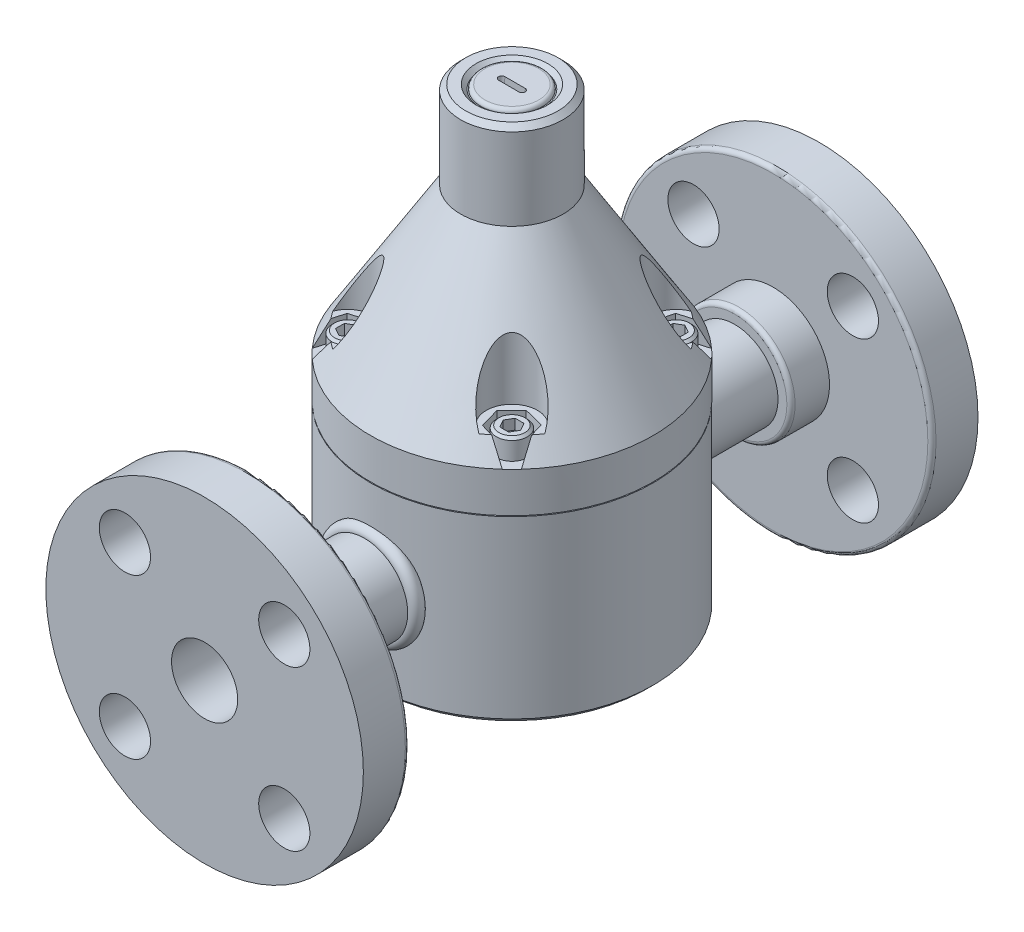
from build123d import *

# Parameters (mm, degrees)
SKETCH1_R                = 43.815
EXTRUDE1_DEPTH           = 140.97
SKETCH3_R                = 11.1125
EXTRUDE2_DEPTH           = 1.27
EXTRUDE2_DRAFT           = -45
CHAMFER1_SIZE            = 1.5748
SKETCH4_R                = 9.525
EXTRUDE3_DEPTH           = 1.27
FILLET1_R                = 1.143
EXTRUDE4_DEPTH           = 3.302
EXTRUDE4_DRAFT           = -1
SKETCH6_R                = 7.9375
EXTRUDE5_DEPTH           = 22.86
EXTRUDE6_DEPTH           = 6.35
CIRPATTERN1_COUNT        = 4
SKETCH9_R                = 4.7625
EXTRUDE7_DEPTH           = 6.35
EXTRUDE8_DEPTH           = 3.175
CIRPATTERN2_COUNT        = 4
CHAMFER2_SIZE            = 0.762
SKETCH11_R               = 49.2125
BOSS_EXTRUDE1_DEPTH      = 14.2748
SKETCH12_R               = 17.4625
BOSS_EXTRUDE2_DEPTH      = 26.2128
BOSS_EXTRUDE3_REACH      = 206.043
BOSS_EXTRUDE3_END_RADIUS = 43.815
SKETCH13_R               = 13.4366
SKETCH14_R               = 10.2616
CUT_EXTRUDE1_DEPTH       = 25.4
SKETCH15_R               = 7.9375
CUT_EXTRUDE2_DEPTH       = 25.4
CIRPATTERN3_COUNT        = 4
SKETCH18_R               = 49.2125
BOSS_EXTRUDE5_DEPTH      = 14.2748
BOSS_EXTRUDE6_START      = 26.2128
SKETCH19_R               = 17.4625
BOSS_EXTRUDE6_DEPTH      = 26.2128
BOSS_EXTRUDE7_REACH      = 244.043
BOSS_EXTRUDE7_END_RADIUS = 43.815
SKETCH20_R               = 13.4366
CUT_EXTRUDE3_START       = 25.4
SKETCH21_R               = 10.2616
CUT_EXTRUDE3_DEPTH       = 25.4
CUT_EXTRUDE4_START       = 25.4
SKETCH22_R               = 7.9375
CUT_EXTRUDE4_DEPTH       = 25.4
CIRPATTERN4_COUNT        = 4
FILLET3_R                = 1.27


with BuildPart() as part:
    # Sketch1 → Extrude1 (new body)
    with BuildSketch(Plane(origin=(0, 0, 0), x_dir=(1, 0, 0), z_dir=(0, 1, 0))):
        with Locations(Location((0, 0, 0), (0, 0, 270))):
            Circle(SKETCH1_R)
    extrude(amount=EXTRUDE1_DEPTH)

    # Sketch2 → Cut-Revolve1 (revolve, cut)
    with BuildSketch(Plane.XY, mode=Mode.PRIVATE) as cut_revolve1_sk:
        Polygon((-43.815, 56.134), (-43.815, 68.58), (-15.875, 114.046), (-15.875, 147.034008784), (-49.44729897, 147.034008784), (-49.44729897, 55.88), (-30.226, 55.88), (-30.226, 56.134), align=None)
    revolve(cut_revolve1_sk.sketch.rotate(Axis((0, 0, 0), (0, 1, 0)), 270), axis=Axis((0, 0, 0), (0, 1, 0)), mode=Mode.SUBTRACT)


with BuildPart() as extrude2_tool:
    # Sketch3 → Extrude2 (with draft: the straight prism first)
    with BuildSketch(Plane(origin=(0, 140.97, 0), x_dir=(-1, 0, 0), z_dir=(0, 1, 0))):
        Circle(SKETCH3_R)
    extrude(amount=-EXTRUDE2_DEPTH)
    # Extrude2: the draft: its side faces are tilted about the plane it starts from
    extrude2_sides = [extrude2_tool.faces().sort_by_distance(p)[0] for p in [
        (11.1125, 140.335, 0),
    ]]
    draft(extrude2_sides, Plane(origin=(0, 140.97, 0), x_dir=(-1, 0, 0), z_dir=(0, 1, 0)), EXTRUDE2_DRAFT)


with BuildPart() as part_1:
    add(part.part)

    # Extrude2: cut by extrude2_tool
    add(extrude2_tool.part, mode=Mode.SUBTRACT)

    # Chamfer1
    chamfer1_edges = [part_1.edges().sort_by_distance(p)[0] for p in [
        (0, 0, -43.815),
        (0, 140.97, 15.875),
    ]]
    chamfer(chamfer1_edges, length=CHAMFER1_SIZE)

    # Sketch4 → Extrude3 (add)
    with BuildSketch(Plane(origin=(0, 140.97, 0), x_dir=(-1, 0, 0), z_dir=(0, 1, 0))):
        with Locations(Location((0, 0, 0), (0, 0, 90))):
            Circle(SKETCH4_R)
    extrude(amount=-EXTRUDE3_DEPTH)

    # Fillet1
    fillet1_edges = [part_1.edges().sort_by_distance(p)[0] for p in [
        (0, 140.97, -9.525),
    ]]
    fillet(fillet1_edges, radius=FILLET1_R)


with BuildPart() as extrude4_tool:
    # Sketch5 → Extrude4 (with draft: the straight prism first)
    with BuildSketch(Plane(origin=(0, 140.97, 0), x_dir=(-1, 0, 0), z_dir=(0, 1, 0))):
        with BuildLine():
            Line((3.175, 0.9652), (-3.175, 0.9652))
            ThreePointArc((-3.175, 0.9652), (-4.1402, 0), (-3.175, -0.9652))
            Line((-3.175, -0.9652), (3.175, -0.9652))
            ThreePointArc((3.175, -0.9652), (4.1402, 0), (3.175, 0.9652))
        make_face()
    extrude(amount=-EXTRUDE4_DEPTH)
    # Extrude4: the draft: its side faces are tilted about the plane it starts from
    extrude4_sides = [extrude4_tool.faces().sort_by_distance(p)[0] for p in [
        (-4.1402, 139.319, 0),
        (0, 139.319, 0.9652),
        (4.1402, 139.319, 0),
        (0, 139.319, -0.9652),
    ]]
    draft(extrude4_sides, Plane(origin=(0, 140.97, 0), x_dir=(-1, 0, 0), z_dir=(0, 1, 0)), EXTRUDE4_DRAFT)


with BuildPart() as part_2:
    add(part_1.part)

    # Extrude4: cut by extrude4_tool
    add(extrude4_tool.part, mode=Mode.SUBTRACT)

    # Sketch6 → Extrude5 (cut)
    with BuildSketch(Plane(origin=(0, 74.93, 0), x_dir=(-1, 0, 0), z_dir=(0, 1, 0))):
        with Locations((-25.459026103, 25.459026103)):
            Circle(SKETCH6_R)
    extrude5 = extrude(amount=EXTRUDE5_DEPTH, mode=Mode.SUBTRACT)

    # Sketch8 → Extrude6 (cut)
    with BuildSketch(Plane(origin=(0, 74.93, 0), x_dir=(-1, 0, 0), z_dir=(0, 1, 0))):
        Polygon((-29.948607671, 20.824591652), (-23.690278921, 19.253717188), (-19.200697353, 23.888151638), (-20.969444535, 30.093460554), (-33.591654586, 33.591654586), align=None)
    extrude6 = extrude(amount=-EXTRUDE6_DEPTH, mode=Mode.SUBTRACT)

    # CirPattern1: Extrude5, Extrude6 ×4 about axis
    cirpattern1_axis = Axis((0, 0, 0), (0, 1, 0))
    add([extrude5.rotate(cirpattern1_axis, i * 360 / CIRPATTERN1_COUNT) for i in range(1, CIRPATTERN1_COUNT)], mode=Mode.SUBTRACT)
    add([extrude6.rotate(cirpattern1_axis, i * 360 / CIRPATTERN1_COUNT) for i in range(1, CIRPATTERN1_COUNT)], mode=Mode.SUBTRACT)

    # Sketch9 → Extrude7 (add)
    with BuildSketch(Plane(origin=(0, 74.93, 0), x_dir=(-1, 0, 0), z_dir=(0, 1, 0))):
        with Locations(Location((-25.459026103, 25.459026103, 0), (0, 0, 90))):
            Circle(SKETCH9_R)
    extrude7 = extrude(amount=-EXTRUDE7_DEPTH)

    # Sketch10 → Extrude8 (cut)
    with BuildSketch(Plane(origin=(0, 74.93, 0), x_dir=(-1, 0, 0), z_dir=(0, 1, 0))):
        Polygon((-28.187127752, 25.459026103), (-26.823076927, 23.096420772), (-24.094975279, 23.096420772), (-22.730924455, 25.459026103), (-24.094975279, 27.821631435), (-26.823076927, 27.821631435), align=None)
    extrude8 = extrude(amount=-EXTRUDE8_DEPTH, mode=Mode.SUBTRACT)

    # CirPattern2: Extrude7, Extrude8 ×4 about axis
    cirpattern2_axis = Axis((0, 0, 0), (0, 1, 0))
    add([extrude7.rotate(cirpattern2_axis, i * 360 / CIRPATTERN2_COUNT) for i in range(1, CIRPATTERN2_COUNT)])
    add([extrude8.rotate(cirpattern2_axis, i * 360 / CIRPATTERN2_COUNT) for i in range(1, CIRPATTERN2_COUNT)], mode=Mode.SUBTRACT)

    # Chamfer2
    chamfer2_edges = [part_2.edges().sort_by_distance(p)[0] for p in [
        (25.459026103, 74.93, 20.696526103),
        (-20.696526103, 74.93, 25.459026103),
        (-25.459026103, 74.93, -20.696526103),
        (20.696526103, 74.93, -25.459026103),
    ]]
    chamfer(chamfer2_edges, length=CHAMFER2_SIZE)



with BuildPart() as body_2:
    # Sketch11 → Boss-Extrude1 (new body)
    with BuildSketch(Plane.XY.offset(95.25)):
        with Locations((0, 28.575)):
            Circle(SKETCH11_R)
    extrude(amount=-BOSS_EXTRUDE1_DEPTH)

    # Sketch12 → Boss-Extrude2 (add)
    with BuildSketch(Plane.XY.offset(95.25)):
        with Locations((0, 28.575)):
            Circle(SKETCH12_R)
    extrude(amount=-BOSS_EXTRUDE2_DEPTH)


with BuildPart() as part_3:
    add(part_2.part)

    add(body_2.part)  # Boss-Extrude3 merges body 2
    # Boss-Extrude3: up to this cylinder (the profile starts outside it)
    boss_extrude3_end = Plane(origin=(0, 28.575, 0), z_dir=(0, -1, 0)) * Cylinder(BOSS_EXTRUDE3_END_RADIUS, 500.716, mode=Mode.PRIVATE)
    # Sketch13 → Boss-Extrude3 (add, up to the surface)
    with BuildSketch(Plane.XY.offset(95.25), mode=Mode.PRIVATE) as boss_extrude3_sk1:
        with Locations((0, 28.575)):
            Circle(SKETCH13_R)
    boss_extrude3_tool1 = extrude(boss_extrude3_sk1.sketch, amount=-BOSS_EXTRUDE3_REACH, mode=Mode.PRIVATE) - boss_extrude3_end
    add(boss_extrude3_tool1.solids().sort_by_distance((0, 28.575, 95.25))[0])

    # Sketch14 → Cut-Extrude1 (cut)
    with BuildSketch(Plane.XY.offset(95.25)):
        with Locations((0, 28.575)):
            Circle(SKETCH14_R)
    extrude(amount=-CUT_EXTRUDE1_DEPTH, mode=Mode.SUBTRACT)

    # Sketch15 → Cut-Extrude2 (cut)
    with BuildSketch(Plane.XY.offset(95.25)):
        with Locations((-24.695704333, 53.270704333)):
            Circle(SKETCH15_R)
    cut_extrude2 = extrude(amount=-CUT_EXTRUDE2_DEPTH, mode=Mode.SUBTRACT)

    # CirPattern3: Cut-Extrude2 ×4 about axis
    cirpattern3_axis = Axis((0, 28.575, 0), (0, 0, 1))
    for i in range(1, CIRPATTERN3_COUNT):
        add(cut_extrude2.rotate(cirpattern3_axis, i * 360 / CIRPATTERN3_COUNT), mode=Mode.SUBTRACT)

    # Sketch16 → Revolve1 (revolve)
    with BuildSketch(Plane(origin=(0, 0, 0), x_dir=(0, 0, -1), z_dir=(1, 0, 0)), mode=Mode.PRIVATE) as revolve1_sk:
        with BuildLine():
            Line((-41.255708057, 38.10228525), (-45.737066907, 38.10228525))
            Line((-45.737066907, 38.10228525), (-45.737066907, 42.0116))
            ThreePointArc((-45.737066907, 42.0116), (-43.699332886, 44.263475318), (-41.255708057, 42.460145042))
            Line((-41.255708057, 42.460145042), (-41.255708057, 38.10228525))
        make_face()
    revolve1 = revolve(revolve1_sk.sketch.rotate(Axis((0, 28.575, 95.25), (0, 0, -1)), 90), axis=Axis((0, 28.575, 95.25), (0, 0, -1)))



with BuildPart() as body_2_2:
    # Sketch18 → Boss-Extrude5 (new body)
    with BuildSketch(Plane.XY.offset(-95.25)):
        with Locations((0, 28.575)):
            Circle(SKETCH18_R)
    extrude(amount=BOSS_EXTRUDE5_DEPTH)

    # Sketch19 → Boss-Extrude6 (add)
    with BuildSketch(Plane.XY.offset(-95.25).offset(BOSS_EXTRUDE6_START)):
        with Locations((0, 28.575)):
            Circle(SKETCH19_R)
    extrude(amount=-BOSS_EXTRUDE6_DEPTH)


with BuildPart() as part_4:
    add(part_3.part)

    add(body_2_2.part)  # Boss-Extrude7 merges body 2 2
    # Boss-Extrude7: up to this cylinder (the profile starts outside it)
    boss_extrude7_end = Plane(origin=(0, 28.575, 0), z_dir=(0, -1, 0)) * Cylinder(BOSS_EXTRUDE7_END_RADIUS, 576.716, mode=Mode.PRIVATE)
    # Sketch20 → Boss-Extrude7 (add, up to the surface)
    with BuildSketch(Plane.XY.offset(-95.25), mode=Mode.PRIVATE) as boss_extrude7_sk1:
        with Locations((0, 28.575)):
            Circle(SKETCH20_R)
    boss_extrude7_tool1 = extrude(boss_extrude7_sk1.sketch, amount=BOSS_EXTRUDE7_REACH, mode=Mode.PRIVATE) - boss_extrude7_end
    add(boss_extrude7_tool1.solids().sort_by_distance((0, 28.575, -95.25))[0])

    # Sketch21 → Cut-Extrude3 (cut)
    with BuildSketch(Plane.XY.offset(-95.25).offset(CUT_EXTRUDE3_START)):
        with Locations((0, 28.575)):
            Circle(SKETCH21_R)
    extrude(amount=-CUT_EXTRUDE3_DEPTH, mode=Mode.SUBTRACT)

    # Sketch22 → Cut-Extrude4 (cut)
    with BuildSketch(Plane.XY.offset(-95.25).offset(CUT_EXTRUDE4_START)):
        with Locations((24.695704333, 53.270704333)):
            Circle(SKETCH22_R)
    cut_extrude4 = extrude(amount=-CUT_EXTRUDE4_DEPTH, mode=Mode.SUBTRACT)

    # CirPattern4: Cut-Extrude4 ×4 about axis
    cirpattern4_axis = Axis((0, 28.575, 0), (0, 0, 1))
    for i in range(1, CIRPATTERN4_COUNT):
        add(cut_extrude4.rotate(cirpattern4_axis, i * 360 / CIRPATTERN4_COUNT), mode=Mode.SUBTRACT)

    # Fillet3
    fillet3_edges = [part_4.edges().sort_by_distance(p)[0] for p in [
        (-49.2125, 28.575, 80.9752),
        (-17.4625, 28.575, 69.0372),
        (-17.4625, 28.575, -69.0372),
        (-49.2125, 28.575, -80.9752),
    ]]
    fillet(fillet3_edges, radius=FILLET3_R)

    # Mirror1: Revolve1 across plane
    add(revolve1.mirror(Plane.XY))


solid = part_4.part
